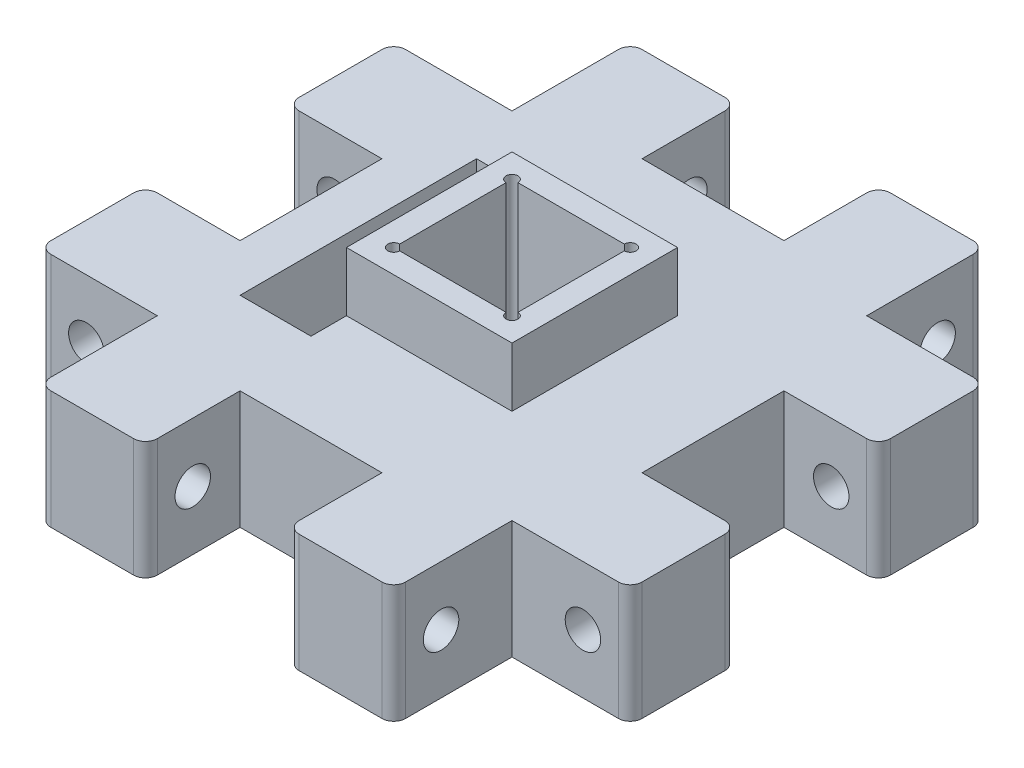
from build123d import *

# Parameters (mm, degrees)
SKETCH_1_W          = 50
SKETCH_1_H          = 50
SKETCH_1_W_2        = 10
SKETCH_1_H_2        = 10
EXTRUDE_1_DEPTH     = 10
CUT_EXTRUDE_1_REACH = 38.742
SKETCH_2_W          = 12
SKETCH_2_H          = 8
SKETCH_2_W_2        = 8
SKETCH_2_H_2        = 12
CUT_EXTRUDE_2_REACH = 58.789
SKETCH_4_R          = 1.5
CUT_EXTRUDE_3_REACH = 58.789
SKETCH_5_R          = 1.5
CUT_EXTRUDE_4_REACH = 58.789
SKETCH_6_R          = 1.5
CUT_EXTRUDE_5_REACH = 58.789
SKETCH_7_R          = 1.5
CUT_EXTRUDE_6_REACH = 38.742
SKETCH_8_W          = 6
SKETCH_8_H          = 20
CUT_EXTRUDE_7_REACH = 38.742
SKETCH_9_R          = 0.5
SKETCH_10_W         = 14
SKETCH_10_H         = 14
EXTRUDE_2_DEPTH     = 5
CUT_EXTRUDE_8_REACH = 40.406
SKETCH_12_W         = 10
SKETCH_12_H         = 10
FILLET_2_R          = 1


with BuildPart() as part:
    # Sketch 1 → Extrude 1 (new body)
    with BuildSketch(Plane(origin=(0, 0, 0), x_dir=(1, 0, 0), z_dir=(0, 1, 0))):
        Rectangle(SKETCH_1_W, SKETCH_1_H)
        Rectangle(SKETCH_1_W_2, SKETCH_1_H_2, mode=Mode.SUBTRACT)
    extrude(amount=EXTRUDE_1_DEPTH)

    # Sketch 2 → Cut-Extrude 1 (cut, up to next)
    with BuildSketch(Plane(origin=(0, 10, 0), x_dir=(1, 0, 0), z_dir=(0, 1, 0)), mode=Mode.PRIVATE) as cut_extrude_1_sk1:
        with Locations((0, 21)):
            Rectangle(SKETCH_2_W, SKETCH_2_H)
    cut_extrude_1_tool1 = extrude(cut_extrude_1_sk1.sketch, amount=-CUT_EXTRUDE_1_REACH, mode=Mode.PRIVATE) & part.part
    # Sketch 2 → Cut-Extrude 1 (cut, up to next)
    with BuildSketch(Plane(origin=(0, 10, 0), x_dir=(1, 0, 0), z_dir=(0, 1, 0)), mode=Mode.PRIVATE) as cut_extrude_1_sk2:
        with Locations((21, 0)):
            Rectangle(SKETCH_2_W_2, SKETCH_2_H_2)
    cut_extrude_1_tool2 = extrude(cut_extrude_1_sk2.sketch, amount=-CUT_EXTRUDE_1_REACH, mode=Mode.PRIVATE) & part.part
    # Sketch 2 → Cut-Extrude 1 (cut, up to next)
    with BuildSketch(Plane(origin=(0, 10, 0), x_dir=(1, 0, 0), z_dir=(0, 1, 0)), mode=Mode.PRIVATE) as cut_extrude_1_sk3:
        with Locations((0, -21)):
            Rectangle(SKETCH_2_W, SKETCH_2_H)
    cut_extrude_1_tool3 = extrude(cut_extrude_1_sk3.sketch, amount=-CUT_EXTRUDE_1_REACH, mode=Mode.PRIVATE) & part.part
    # Sketch 2 → Cut-Extrude 1 (cut, up to next)
    with BuildSketch(Plane(origin=(0, 10, 0), x_dir=(1, 0, 0), z_dir=(0, 1, 0)), mode=Mode.PRIVATE) as cut_extrude_1_sk4:
        with Locations((-21, 0)):
            Rectangle(SKETCH_2_W_2, SKETCH_2_H_2)
    cut_extrude_1_tool4 = extrude(cut_extrude_1_sk4.sketch, amount=-CUT_EXTRUDE_1_REACH, mode=Mode.PRIVATE) & part.part
    add(cut_extrude_1_tool1.solids().sort_by_distance((0, 10, -21))[0], mode=Mode.SUBTRACT)
    add(cut_extrude_1_tool2.solids().sort_by_distance((21, 10, 0))[0], mode=Mode.SUBTRACT)
    add(cut_extrude_1_tool3.solids().sort_by_distance((0, 10, 21))[0], mode=Mode.SUBTRACT)
    add(cut_extrude_1_tool4.solids().sort_by_distance((-21, 10, 0))[0], mode=Mode.SUBTRACT)

    # Cut-Extrude 2: up to this face of the body (flat: up to its plane)
    cut_extrude_2_end = Plane(part.part.faces().sort_by_distance((25, 5, -15.5))[0])
    # Sketch 4 → Cut-Extrude 2 (cut, up to the picked face)
    with BuildSketch(Plane.ZY.offset(25), mode=Mode.PRIVATE) as cut_extrude_2_sk1:
        with Locations((-21, 5)):
            Circle(SKETCH_4_R)
    cut_extrude_2_tool1 = split(extrude(cut_extrude_2_sk1.sketch, amount=-CUT_EXTRUDE_2_REACH, mode=Mode.PRIVATE), bisect_by=cut_extrude_2_end, keep=Keep.BOTH, mode=Mode.PRIVATE)
    add(cut_extrude_2_tool1.solids().sort_by(Axis((-25, 5, -21), (1, 0, 0)))[0], mode=Mode.SUBTRACT)

    # Cut-Extrude 3: up to this face of the body (flat: up to its plane)
    cut_extrude_3_end = Plane(part.part.faces().sort_by_distance((-15.5, 5, 25))[0])
    # Sketch 5 → Cut-Extrude 3 (cut, up to the picked face)
    with BuildSketch(Plane(origin=(0, 0, -25), x_dir=(-1, 0, 0), z_dir=(0, 0, -1)), mode=Mode.PRIVATE) as cut_extrude_3_sk1:
        with Locations((21, 5)):
            Circle(SKETCH_5_R)
    cut_extrude_3_tool1 = split(extrude(cut_extrude_3_sk1.sketch, amount=-CUT_EXTRUDE_3_REACH, mode=Mode.PRIVATE), bisect_by=cut_extrude_3_end, keep=Keep.BOTH, mode=Mode.PRIVATE)
    add(cut_extrude_3_tool1.solids().sort_by(Axis((-21, 5, -25), (0, 0, 1)))[0], mode=Mode.SUBTRACT)

    # Cut-Extrude 4: up to this face of the body (flat: up to its plane)
    cut_extrude_4_end = Plane(part.part.faces().sort_by_distance((25, 5, 15.5))[0])
    # Sketch 6 → Cut-Extrude 4 (cut, up to the picked face)
    with BuildSketch(Plane.ZY.offset(25), mode=Mode.PRIVATE) as cut_extrude_4_sk1:
        with Locations((21, 5)):
            Circle(SKETCH_6_R)
    cut_extrude_4_tool1 = split(extrude(cut_extrude_4_sk1.sketch, amount=-CUT_EXTRUDE_4_REACH, mode=Mode.PRIVATE), bisect_by=cut_extrude_4_end, keep=Keep.BOTH, mode=Mode.PRIVATE)
    add(cut_extrude_4_tool1.solids().sort_by(Axis((-25, 5, 21), (1, 0, 0)))[0], mode=Mode.SUBTRACT)

    # Cut-Extrude 5: up to this face of the body (flat: up to its plane)
    cut_extrude_5_end = Plane(part.part.faces().sort_by_distance((15.5, 5, -25))[0])
    # Sketch 7 → Cut-Extrude 5 (cut, up to the picked face)
    with BuildSketch(Plane.XY.offset(25), mode=Mode.PRIVATE) as cut_extrude_5_sk1:
        with Locations((21, 5)):
            Circle(SKETCH_7_R)
    cut_extrude_5_tool1 = split(extrude(cut_extrude_5_sk1.sketch, amount=-CUT_EXTRUDE_5_REACH, mode=Mode.PRIVATE), bisect_by=cut_extrude_5_end, keep=Keep.BOTH, mode=Mode.PRIVATE)
    add(cut_extrude_5_tool1.solids().sort_by(Axis((21, 5, 25), (0, 0, -1)))[0], mode=Mode.SUBTRACT)

    # Sketch 8 → Cut-Extrude 6 (cut, up to next)
    with BuildSketch(Plane.XZ, mode=Mode.PRIVATE) as cut_extrude_6_sk1:
        with Locations((-10, 0)):
            Rectangle(SKETCH_8_W, SKETCH_8_H)
    cut_extrude_6_tool1 = extrude(cut_extrude_6_sk1.sketch, amount=-CUT_EXTRUDE_6_REACH, mode=Mode.PRIVATE) & part.part
    add(cut_extrude_6_tool1.solids().sort_by_distance((-10, 0, 0))[0], mode=Mode.SUBTRACT)

    # Sketch 9 → Cut-Extrude 7 (cut, up to next)
    with BuildSketch(Plane(origin=(0, 0, 0), x_dir=(-1, 0, 0), z_dir=(0, -1, 0)), mode=Mode.PRIVATE) as cut_extrude_7_sk1:
        with Locations((-5, -5)):
            Circle(SKETCH_9_R)
    cut_extrude_7_tool1 = extrude(cut_extrude_7_sk1.sketch, amount=-CUT_EXTRUDE_7_REACH, mode=Mode.PRIVATE) & part.part
    # Sketch 9 → Cut-Extrude 7 (cut, up to next)
    with BuildSketch(Plane(origin=(0, 0, 0), x_dir=(-1, 0, 0), z_dir=(0, -1, 0)), mode=Mode.PRIVATE) as cut_extrude_7_sk2:
        with Locations((-5, 5)):
            Circle(SKETCH_9_R)
    cut_extrude_7_tool2 = extrude(cut_extrude_7_sk2.sketch, amount=-CUT_EXTRUDE_7_REACH, mode=Mode.PRIVATE) & part.part
    # Sketch 9 → Cut-Extrude 7 (cut, up to next)
    with BuildSketch(Plane(origin=(0, 0, 0), x_dir=(-1, 0, 0), z_dir=(0, -1, 0)), mode=Mode.PRIVATE) as cut_extrude_7_sk3:
        with Locations((5, 5)):
            Circle(SKETCH_9_R)
    cut_extrude_7_tool3 = extrude(cut_extrude_7_sk3.sketch, amount=-CUT_EXTRUDE_7_REACH, mode=Mode.PRIVATE) & part.part
    # Sketch 9 → Cut-Extrude 7 (cut, up to next)
    with BuildSketch(Plane(origin=(0, 0, 0), x_dir=(-1, 0, 0), z_dir=(0, -1, 0)), mode=Mode.PRIVATE) as cut_extrude_7_sk4:
        with Locations((5, -5)):
            Circle(SKETCH_9_R)
    cut_extrude_7_tool4 = extrude(cut_extrude_7_sk4.sketch, amount=-CUT_EXTRUDE_7_REACH, mode=Mode.PRIVATE) & part.part
    add(cut_extrude_7_tool1.solids().sort_by_distance((5, 0, 5))[0], mode=Mode.SUBTRACT)
    add(cut_extrude_7_tool2.solids().sort_by_distance((5, 0, -5))[0], mode=Mode.SUBTRACT)
    add(cut_extrude_7_tool3.solids().sort_by_distance((-5, 0, -5))[0], mode=Mode.SUBTRACT)
    add(cut_extrude_7_tool4.solids().sort_by_distance((-5, 0, 5))[0], mode=Mode.SUBTRACT)

    # Sketch 10 → Extrude 2 (add)
    with BuildSketch(Plane(origin=(0, 10, 0), x_dir=(1, 0, 0), z_dir=(0, 1, 0))):
        Rectangle(SKETCH_10_W, SKETCH_10_H)
        with BuildLine():
            Line((4.5, 5), (-4.5, 5))
            ThreePointArc((-4.5, 5), (-5.353553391, 5.353553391), (-5, 4.5))
            Line((-5, 4.5), (-5, -4.5))
            ThreePointArc((-5, -4.5), (-5.353553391, -5.353553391), (-4.5, -5))
            Line((-4.5, -5), (4.5, -5))
            ThreePointArc((4.5, -5), (5.353553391, -5.353553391), (5, -4.5))
            Line((5, -4.5), (5, 4.5))
            ThreePointArc((5, 4.5), (5.353553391, 5.353553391), (4.5, 5))
        make_face(mode=Mode.SUBTRACT)
    extrude(amount=EXTRUDE_2_DEPTH)

    # Sketch 12 → Cut-Extrude 8 (cut, up to next)
    with BuildSketch(Plane.XZ, mode=Mode.PRIVATE) as cut_extrude_8_sk1:
        with Locations((-20, 20)):
            Rectangle(SKETCH_12_W, SKETCH_12_H)
    cut_extrude_8_tool1 = extrude(cut_extrude_8_sk1.sketch, amount=-CUT_EXTRUDE_8_REACH, mode=Mode.PRIVATE) & part.part
    # Sketch 12 → Cut-Extrude 8 (cut, up to next)
    with BuildSketch(Plane.XZ, mode=Mode.PRIVATE) as cut_extrude_8_sk2:
        with Locations((20, 20)):
            Rectangle(SKETCH_12_W, SKETCH_12_H)
    cut_extrude_8_tool2 = extrude(cut_extrude_8_sk2.sketch, amount=-CUT_EXTRUDE_8_REACH, mode=Mode.PRIVATE) & part.part
    # Sketch 12 → Cut-Extrude 8 (cut, up to next)
    with BuildSketch(Plane.XZ, mode=Mode.PRIVATE) as cut_extrude_8_sk3:
        with Locations((20, -20)):
            Rectangle(SKETCH_12_W, SKETCH_12_H)
    cut_extrude_8_tool3 = extrude(cut_extrude_8_sk3.sketch, amount=-CUT_EXTRUDE_8_REACH, mode=Mode.PRIVATE) & part.part
    # Sketch 12 → Cut-Extrude 8 (cut, up to next)
    with BuildSketch(Plane.XZ, mode=Mode.PRIVATE) as cut_extrude_8_sk4:
        with Locations((-20, -20)):
            Rectangle(SKETCH_12_W, SKETCH_12_H)
    cut_extrude_8_tool4 = extrude(cut_extrude_8_sk4.sketch, amount=-CUT_EXTRUDE_8_REACH, mode=Mode.PRIVATE) & part.part
    add(cut_extrude_8_tool1.solids().sort_by_distance((-20, 0, 20))[0], mode=Mode.SUBTRACT)
    add(cut_extrude_8_tool2.solids().sort_by_distance((20, 0, 20))[0], mode=Mode.SUBTRACT)
    add(cut_extrude_8_tool3.solids().sort_by_distance((20, 0, -20))[0], mode=Mode.SUBTRACT)
    add(cut_extrude_8_tool4.solids().sort_by_distance((-20, 0, -20))[0], mode=Mode.SUBTRACT)

    # Fillet 2
    fillet_2_edges = [part.edges().sort_by_distance(p)[0] for p in [
        (-25, 5, 15),
        (-15, 5, 25),
        (25, 5, 15),
        (15, 5, 25),
        (15, 5, -25),
        (25, 5, -15),
        (-25, 5, -15),
        (-15, 5, -25),
        (-6, 5, -25),
        (6, 5, -25),
        (25, 5, -6),
        (25, 5, 6),
        (6, 5, 25),
        (-6, 5, 25),
        (-25, 5, 6),
        (-25, 5, -6),
    ]]
    fillet(fillet_2_edges, radius=FILLET_2_R)


solid = part.part
